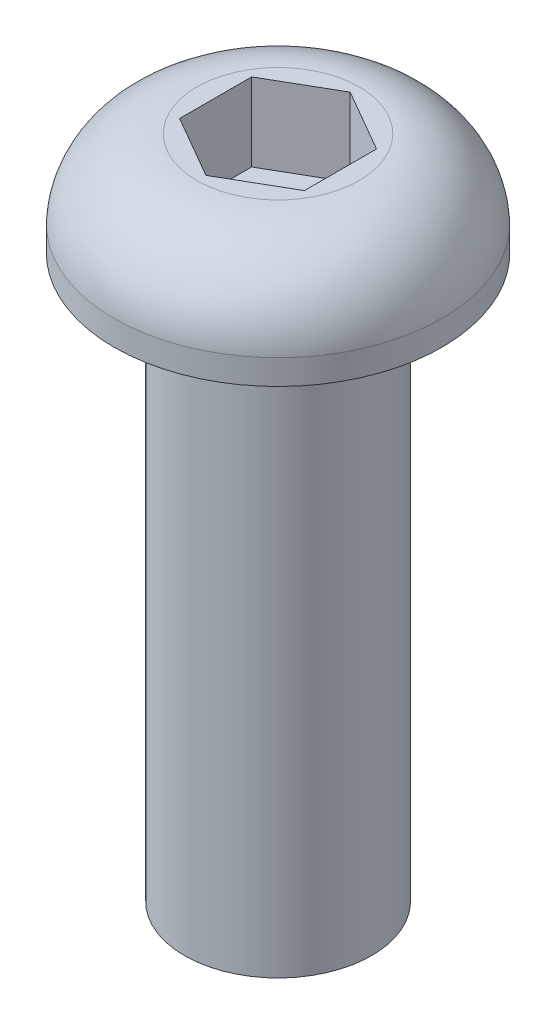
ISO-10303-21;
HEADER;
FILE_DESCRIPTION(('STEP AP214'),'2;1');
FILE_NAME('part.step','',(''),(''),'','','');
FILE_SCHEMA(('AUTOMOTIVE_DESIGN { 1 0 10303 214 1 1 1 1 }'));
ENDSEC;
DATA;
#1=APPLICATION_CONTEXT('core data for automotive mechanical design processes');
#2=APPLICATION_PROTOCOL_DEFINITION('international standard','automotive_design',2000,#1);
#3=PRODUCT_CONTEXT('',#1,'mechanical');
#4=PRODUCT('Part','Part','',(#3));
#5=PRODUCT_RELATED_PRODUCT_CATEGORY('part','',(#4));
#6=PRODUCT_DEFINITION_FORMATION('','',#4);
#7=PRODUCT_DEFINITION_CONTEXT('part definition',#1,'design');
#8=PRODUCT_DEFINITION('design','',#6,#7);
#9=PRODUCT_DEFINITION_SHAPE('','',#8);
#10=(LENGTH_UNIT() NAMED_UNIT(*) SI_UNIT(.MILLI.,.METRE.));
#11=(NAMED_UNIT(*) PLANE_ANGLE_UNIT() SI_UNIT($,.RADIAN.));
#12=(NAMED_UNIT(*) SI_UNIT($,.STERADIAN.) SOLID_ANGLE_UNIT());
#13=UNCERTAINTY_MEASURE_WITH_UNIT(LENGTH_MEASURE(1.E-05),#10,'distance_accuracy_value','');
#14=(GEOMETRIC_REPRESENTATION_CONTEXT(3) GLOBAL_UNCERTAINTY_ASSIGNED_CONTEXT((#13)) GLOBAL_UNIT_ASSIGNED_CONTEXT((#10,
#11,#12)) REPRESENTATION_CONTEXT('',''));
#15=CARTESIAN_POINT('',(0.,0.,0.));
#16=DIRECTION('',(0.,0.,1.));
#17=DIRECTION('',(1.,0.,0.));
#18=AXIS2_PLACEMENT_3D('',#15,#16,#17);
#19=CARTESIAN_POINT('',(0.,0.,0.));
#20=DIRECTION('',(0.,1.,0.));
#21=DIRECTION('',(0.,0.,1.));
#22=AXIS2_PLACEMENT_3D('',#19,#20,#21);
#23=PLANE('',#22);
#24=DIRECTION('',(0.,0.,1.));
#25=VECTOR('',#24,1.);
#26=CARTESIAN_POINT('',(-2.,0.,-1.15470053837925));
#27=LINE('',#26,#25);
#28=CARTESIAN_POINT('',(-2.,0.,-1.15470053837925));
#29=VERTEX_POINT('',#28);
#30=CARTESIAN_POINT('',(-2.,0.,1.15470053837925));
#31=VERTEX_POINT('',#30);
#32=EDGE_CURVE('E49',#29,#31,#27,.T.);
#33=ORIENTED_EDGE('',*,*,#32,.F.);
#34=DIRECTION('',(-0.866025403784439,0.,0.5));
#35=VECTOR('',#34,1.);
#36=CARTESIAN_POINT('',(0.,0.,-2.3094010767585));
#37=LINE('',#36,#35);
#38=CARTESIAN_POINT('',(0.,0.,-2.3094010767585));
#39=VERTEX_POINT('',#38);
#40=EDGE_CURVE('E118',#39,#29,#37,.T.);
#41=ORIENTED_EDGE('',*,*,#40,.F.);
#42=DIRECTION('',(0.866025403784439,0.,0.5));
#43=VECTOR('',#42,1.);
#44=CARTESIAN_POINT('',(0.,0.,-2.3094010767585));
#45=LINE('',#44,#43);
#46=CARTESIAN_POINT('',(2.,0.,-1.15470053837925));
#47=VERTEX_POINT('',#46);
#48=EDGE_CURVE('E113',#39,#47,#45,.T.);
#49=ORIENTED_EDGE('',*,*,#48,.T.);
#50=DIRECTION('',(0.,0.,1.));
#51=VECTOR('',#50,1.);
#52=CARTESIAN_POINT('',(2.,0.,-1.15470053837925));
#53=LINE('',#52,#51);
#54=CARTESIAN_POINT('',(2.,0.,1.15470053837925));
#55=VERTEX_POINT('',#54);
#56=EDGE_CURVE('E111',#47,#55,#53,.T.);
#57=ORIENTED_EDGE('',*,*,#56,.T.);
#58=DIRECTION('',(0.866025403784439,0.,-0.499999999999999));
#59=VECTOR('',#58,1.);
#60=CARTESIAN_POINT('',(0.,0.,2.3094010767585));
#61=LINE('',#60,#59);
#62=CARTESIAN_POINT('',(0.,0.,2.3094010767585));
#63=VERTEX_POINT('',#62);
#64=EDGE_CURVE('E94',#63,#55,#61,.T.);
#65=ORIENTED_EDGE('',*,*,#64,.F.);
#66=DIRECTION('',(-0.866025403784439,0.,-0.5));
#67=VECTOR('',#66,1.);
#68=CARTESIAN_POINT('',(0.,0.,2.3094010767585));
#69=LINE('',#68,#67);
#70=EDGE_CURVE('E104',#63,#31,#69,.T.);
#71=ORIENTED_EDGE('',*,*,#70,.T.);
#72=EDGE_LOOP('',(#33,#41,#49,#57,#65,#71));
#73=FACE_BOUND('',#72,.T.);
#74=CARTESIAN_POINT('',(0.,0.,0.));
#75=DIRECTION('',(0.,1.,0.));
#76=DIRECTION('',(0.,0.,1.));
#77=AXIS2_PLACEMENT_3D('',#74,#75,#76);
#78=CIRCLE('',#77,2.6);
#79=CARTESIAN_POINT('',(0.,0.,2.6));
#80=VERTEX_POINT('',#79);
#81=EDGE_CURVE('E11',#80,#80,#78,.T.);
#82=ORIENTED_EDGE('',*,*,#81,.T.);
#83=EDGE_LOOP('',(#82));
#84=FACE_BOUND('',#83,.T.);
#85=ADVANCED_FACE('F35',(#73,#84),#23,.T.);
#86=CARTESIAN_POINT('',(0.,-2.6545,0.));
#87=DIRECTION('',(0.,1.,0.));
#88=DIRECTION('',(0.,0.,1.));
#89=AXIS2_PLACEMENT_3D('',#86,#87,#88);
#90=DEGENERATE_TOROIDAL_SURFACE('',#89,2.6,2.6545,.T.);
#91=CARTESIAN_POINT('',(0.,-2.5,0.));
#92=DIRECTION('',(0.,1.,0.));
#93=DIRECTION('',(0.,0.,1.));
#94=AXIS2_PLACEMENT_3D('',#91,#92,#93);
#95=CIRCLE('',#94,5.25);
#96=CARTESIAN_POINT('',(0.,-2.5,5.25));
#97=VERTEX_POINT('',#96);
#98=EDGE_CURVE('E42',#97,#97,#95,.T.);
#99=ORIENTED_EDGE('',*,*,#98,.T.);
#100=EDGE_LOOP('',(#99));
#101=FACE_BOUND('',#100,.T.);
#102=ORIENTED_EDGE('',*,*,#81,.F.);
#103=EDGE_LOOP('',(#102));
#104=FACE_BOUND('',#103,.T.);
#105=ADVANCED_FACE('F151',(#101,#104),#90,.T.);
#106=CARTESIAN_POINT('',(0.,25.4,0.));
#107=DIRECTION('',(0.,1.,0.));
#108=DIRECTION('',(0.,0.,1.));
#109=AXIS2_PLACEMENT_3D('',#106,#107,#108);
#110=CYLINDRICAL_SURFACE('',#109,5.25);
#111=CARTESIAN_POINT('',(0.,-3.3,0.));
#112=DIRECTION('',(0.,1.,0.));
#113=DIRECTION('',(0.,0.,1.));
#114=AXIS2_PLACEMENT_3D('',#111,#112,#113);
#115=CIRCLE('',#114,5.25);
#116=CARTESIAN_POINT('',(0.,-3.3,5.25));
#117=VERTEX_POINT('',#116);
#118=EDGE_CURVE('E146',#117,#117,#115,.T.);
#119=ORIENTED_EDGE('',*,*,#118,.T.);
#120=EDGE_LOOP('',(#119));
#121=FACE_BOUND('',#120,.T.);
#122=ORIENTED_EDGE('',*,*,#98,.F.);
#123=EDGE_LOOP('',(#122));
#124=FACE_BOUND('',#123,.T.);
#125=ADVANCED_FACE('F154',(#121,#124),#110,.T.);
#126=CARTESIAN_POINT('',(3.,-3.3,0.));
#127=DIRECTION('',(0.,1.,0.));
#128=DIRECTION('',(0.,0.,1.));
#129=AXIS2_PLACEMENT_3D('',#126,#127,#128);
#130=PLANE('',#129);
#131=ORIENTED_EDGE('',*,*,#118,.F.);
#132=EDGE_LOOP('',(#131));
#133=FACE_BOUND('',#132,.T.);
#134=CARTESIAN_POINT('',(0.,-3.3,0.));
#135=DIRECTION('',(0.,1.,0.));
#136=DIRECTION('',(0.,0.,1.));
#137=AXIS2_PLACEMENT_3D('',#134,#135,#136);
#138=CIRCLE('',#137,3.);
#139=CARTESIAN_POINT('',(0.,-3.3,3.));
#140=VERTEX_POINT('',#139);
#141=EDGE_CURVE('E143',#140,#140,#138,.T.);
#142=ORIENTED_EDGE('',*,*,#141,.T.);
#143=EDGE_LOOP('',(#142));
#144=FACE_BOUND('',#143,.T.);
#145=ADVANCED_FACE('F156',(#133,#144),#130,.F.);
#146=CARTESIAN_POINT('',(0.,25.4,0.));
#147=DIRECTION('',(0.,1.,0.));
#148=DIRECTION('',(0.,0.,1.));
#149=AXIS2_PLACEMENT_3D('',#146,#147,#148);
#150=CYLINDRICAL_SURFACE('',#149,3.);
#151=CARTESIAN_POINT('',(0.,-21.3,0.));
#152=DIRECTION('',(0.,1.,0.));
#153=DIRECTION('',(0.,0.,1.));
#154=AXIS2_PLACEMENT_3D('',#151,#152,#153);
#155=CIRCLE('',#154,3.);
#156=CARTESIAN_POINT('',(0.,-21.3,3.));
#157=VERTEX_POINT('',#156);
#158=EDGE_CURVE('E134',#157,#157,#155,.T.);
#159=ORIENTED_EDGE('',*,*,#158,.T.);
#160=EDGE_LOOP('',(#159));
#161=FACE_BOUND('',#160,.T.);
#162=ORIENTED_EDGE('',*,*,#141,.F.);
#163=EDGE_LOOP('',(#162));
#164=FACE_BOUND('',#163,.T.);
#165=ADVANCED_FACE('F163',(#161,#164),#150,.T.);
#166=CARTESIAN_POINT('',(3.,-21.3,0.));
#167=DIRECTION('',(0.,-1.,0.));
#168=DIRECTION('',(0.,0.,-1.));
#169=AXIS2_PLACEMENT_3D('',#166,#167,#168);
#170=PLANE('',#169);
#171=ORIENTED_EDGE('',*,*,#158,.F.);
#172=EDGE_LOOP('',(#171));
#173=FACE_BOUND('',#172,.T.);
#174=ADVANCED_FACE('F192',(#173),#170,.T.);
#175=CARTESIAN_POINT('',(-2.,-2.5,-1.15470053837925));
#176=DIRECTION('',(-1.,0.,0.));
#177=DIRECTION('',(0.,0.,1.));
#178=AXIS2_PLACEMENT_3D('',#175,#176,#177);
#179=PLANE('',#178);
#180=ORIENTED_EDGE('',*,*,#32,.T.);
#181=DIRECTION('',(0.,1.,0.));
#182=VECTOR('',#181,1.);
#183=CARTESIAN_POINT('',(-2.,-2.5,1.15470053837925));
#184=LINE('',#183,#182);
#185=CARTESIAN_POINT('',(-2.,-2.5,1.15470053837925));
#186=VERTEX_POINT('',#185);
#187=EDGE_CURVE('E101',#186,#31,#184,.T.);
#188=ORIENTED_EDGE('',*,*,#187,.F.);
#189=DIRECTION('',(0.,0.,1.));
#190=VECTOR('',#189,1.);
#191=CARTESIAN_POINT('',(-2.,-2.5,-1.15470053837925));
#192=LINE('',#191,#190);
#193=CARTESIAN_POINT('',(-2.,-2.5,-1.15470053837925));
#194=VERTEX_POINT('',#193);
#195=EDGE_CURVE('E120',#194,#186,#192,.T.);
#196=ORIENTED_EDGE('',*,*,#195,.F.);
#197=DIRECTION('',(0.,1.,0.));
#198=VECTOR('',#197,1.);
#199=CARTESIAN_POINT('',(-2.,-2.5,-1.15470053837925));
#200=LINE('',#199,#198);
#201=EDGE_CURVE('E56',#194,#29,#200,.T.);
#202=ORIENTED_EDGE('',*,*,#201,.T.);
#203=EDGE_LOOP('',(#180,#188,#196,#202));
#204=FACE_BOUND('',#203,.T.);
#205=ADVANCED_FACE('F202',(#204),#179,.F.);
#206=CARTESIAN_POINT('',(0.,-2.5,-2.3094010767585));
#207=DIRECTION('',(-0.5,0.,-0.866025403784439));
#208=DIRECTION('',(-0.866025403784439,0.,0.5));
#209=AXIS2_PLACEMENT_3D('',#206,#207,#208);
#210=PLANE('',#209);
#211=ORIENTED_EDGE('',*,*,#40,.T.);
#212=ORIENTED_EDGE('',*,*,#201,.F.);
#213=DIRECTION('',(-0.866025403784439,0.,0.5));
#214=VECTOR('',#213,1.);
#215=CARTESIAN_POINT('',(0.,-2.5,-2.3094010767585));
#216=LINE('',#215,#214);
#217=CARTESIAN_POINT('',(0.,-2.5,-2.3094010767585));
#218=VERTEX_POINT('',#217);
#219=EDGE_CURVE('E130',#218,#194,#216,.T.);
#220=ORIENTED_EDGE('',*,*,#219,.F.);
#221=DIRECTION('',(0.,1.,0.));
#222=VECTOR('',#221,1.);
#223=CARTESIAN_POINT('',(0.,-2.5,-2.3094010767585));
#224=LINE('',#223,#222);
#225=EDGE_CURVE('E135',#218,#39,#224,.T.);
#226=ORIENTED_EDGE('',*,*,#225,.T.);
#227=EDGE_LOOP('',(#211,#212,#220,#226));
#228=FACE_BOUND('',#227,.T.);
#229=ADVANCED_FACE('F212',(#228),#210,.F.);
#230=CARTESIAN_POINT('',(0.,-2.5,-2.3094010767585));
#231=DIRECTION('',(-0.5,0.,0.866025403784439));
#232=DIRECTION('',(0.866025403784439,0.,0.5));
#233=AXIS2_PLACEMENT_3D('',#230,#231,#232);
#234=PLANE('',#233);
#235=ORIENTED_EDGE('',*,*,#48,.F.);
#236=ORIENTED_EDGE('',*,*,#225,.F.);
#237=DIRECTION('',(0.866025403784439,0.,0.5));
#238=VECTOR('',#237,1.);
#239=CARTESIAN_POINT('',(0.,-2.5,-2.3094010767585));
#240=LINE('',#239,#238);
#241=CARTESIAN_POINT('',(2.,-2.5,-1.15470053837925));
#242=VERTEX_POINT('',#241);
#243=EDGE_CURVE('E128',#218,#242,#240,.T.);
#244=ORIENTED_EDGE('',*,*,#243,.T.);
#245=DIRECTION('',(0.,1.,0.));
#246=VECTOR('',#245,1.);
#247=CARTESIAN_POINT('',(2.,-2.5,-1.15470053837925));
#248=LINE('',#247,#246);
#249=EDGE_CURVE('E137',#242,#47,#248,.T.);
#250=ORIENTED_EDGE('',*,*,#249,.T.);
#251=EDGE_LOOP('',(#235,#236,#244,#250));
#252=FACE_BOUND('',#251,.T.);
#253=ADVANCED_FACE('F221',(#252),#234,.T.);
#254=CARTESIAN_POINT('',(2.,-2.5,-1.15470053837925));
#255=DIRECTION('',(-1.,0.,0.));
#256=DIRECTION('',(0.,0.,1.));
#257=AXIS2_PLACEMENT_3D('',#254,#255,#256);
#258=PLANE('',#257);
#259=ORIENTED_EDGE('',*,*,#56,.F.);
#260=ORIENTED_EDGE('',*,*,#249,.F.);
#261=DIRECTION('',(0.,0.,1.));
#262=VECTOR('',#261,1.);
#263=CARTESIAN_POINT('',(2.,-2.5,-1.15470053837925));
#264=LINE('',#263,#262);
#265=CARTESIAN_POINT('',(2.,-2.5,1.15470053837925));
#266=VERTEX_POINT('',#265);
#267=EDGE_CURVE('E126',#242,#266,#264,.T.);
#268=ORIENTED_EDGE('',*,*,#267,.T.);
#269=DIRECTION('',(0.,1.,0.));
#270=VECTOR('',#269,1.);
#271=CARTESIAN_POINT('',(2.,-2.5,1.15470053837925));
#272=LINE('',#271,#270);
#273=EDGE_CURVE('E100',#266,#55,#272,.T.);
#274=ORIENTED_EDGE('',*,*,#273,.T.);
#275=EDGE_LOOP('',(#259,#260,#268,#274));
#276=FACE_BOUND('',#275,.T.);
#277=ADVANCED_FACE('F230',(#276),#258,.T.);
#278=CARTESIAN_POINT('',(0.,-2.5,2.3094010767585));
#279=DIRECTION('',(0.5,0.,0.866025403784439));
#280=DIRECTION('',(0.866025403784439,0.,-0.5));
#281=AXIS2_PLACEMENT_3D('',#278,#279,#280);
#282=PLANE('',#281);
#283=ORIENTED_EDGE('',*,*,#64,.T.);
#284=ORIENTED_EDGE('',*,*,#273,.F.);
#285=DIRECTION('',(0.866025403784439,0.,-0.499999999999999));
#286=VECTOR('',#285,1.);
#287=CARTESIAN_POINT('',(0.,-2.5,2.3094010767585));
#288=LINE('',#287,#286);
#289=CARTESIAN_POINT('',(0.,-2.5,2.3094010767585));
#290=VERTEX_POINT('',#289);
#291=EDGE_CURVE('E97',#290,#266,#288,.T.);
#292=ORIENTED_EDGE('',*,*,#291,.F.);
#293=DIRECTION('',(0.,1.,0.));
#294=VECTOR('',#293,1.);
#295=CARTESIAN_POINT('',(0.,-2.5,2.3094010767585));
#296=LINE('',#295,#294);
#297=EDGE_CURVE('E89',#290,#63,#296,.T.);
#298=ORIENTED_EDGE('',*,*,#297,.T.);
#299=EDGE_LOOP('',(#283,#284,#292,#298));
#300=FACE_BOUND('',#299,.T.);
#301=ADVANCED_FACE('F91',(#300),#282,.F.);
#302=CARTESIAN_POINT('',(0.,-2.5,2.3094010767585));
#303=DIRECTION('',(0.5,0.,-0.866025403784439));
#304=DIRECTION('',(-0.866025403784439,0.,-0.5));
#305=AXIS2_PLACEMENT_3D('',#302,#303,#304);
#306=PLANE('',#305);
#307=ORIENTED_EDGE('',*,*,#70,.F.);
#308=ORIENTED_EDGE('',*,*,#297,.F.);
#309=DIRECTION('',(-0.866025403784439,0.,-0.5));
#310=VECTOR('',#309,1.);
#311=CARTESIAN_POINT('',(0.,-2.5,2.3094010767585));
#312=LINE('',#311,#310);
#313=EDGE_CURVE('E123',#290,#186,#312,.T.);
#314=ORIENTED_EDGE('',*,*,#313,.T.);
#315=ORIENTED_EDGE('',*,*,#187,.T.);
#316=EDGE_LOOP('',(#307,#308,#314,#315));
#317=FACE_BOUND('',#316,.T.);
#318=ADVANCED_FACE('F105',(#317),#306,.T.);
#319=CARTESIAN_POINT('',(-2.,-2.5,3.46410161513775));
#320=DIRECTION('',(0.,1.,0.));
#321=DIRECTION('',(0.,0.,1.));
#322=AXIS2_PLACEMENT_3D('',#319,#320,#321);
#323=PLANE('',#322);
#324=ORIENTED_EDGE('',*,*,#195,.T.);
#325=ORIENTED_EDGE('',*,*,#313,.F.);
#326=ORIENTED_EDGE('',*,*,#291,.T.);
#327=ORIENTED_EDGE('',*,*,#267,.F.);
#328=ORIENTED_EDGE('',*,*,#243,.F.);
#329=ORIENTED_EDGE('',*,*,#219,.T.);
#330=EDGE_LOOP('',(#324,#325,#326,#327,#328,#329));
#331=FACE_BOUND('',#330,.T.);
#332=ADVANCED_FACE('F257',(#331),#323,.T.);
#333=CLOSED_SHELL('',(#85,#105,#125,#145,#165,#174,#205,#229,#253,#277,#301,#318,#332));
#334=MANIFOLD_SOLID_BREP('B2',#333);
#335=ADVANCED_BREP_SHAPE_REPRESENTATION('',(#18,#334),#14);
#336=SHAPE_DEFINITION_REPRESENTATION(#9,#335);
ENDSEC;
END-ISO-10303-21;
